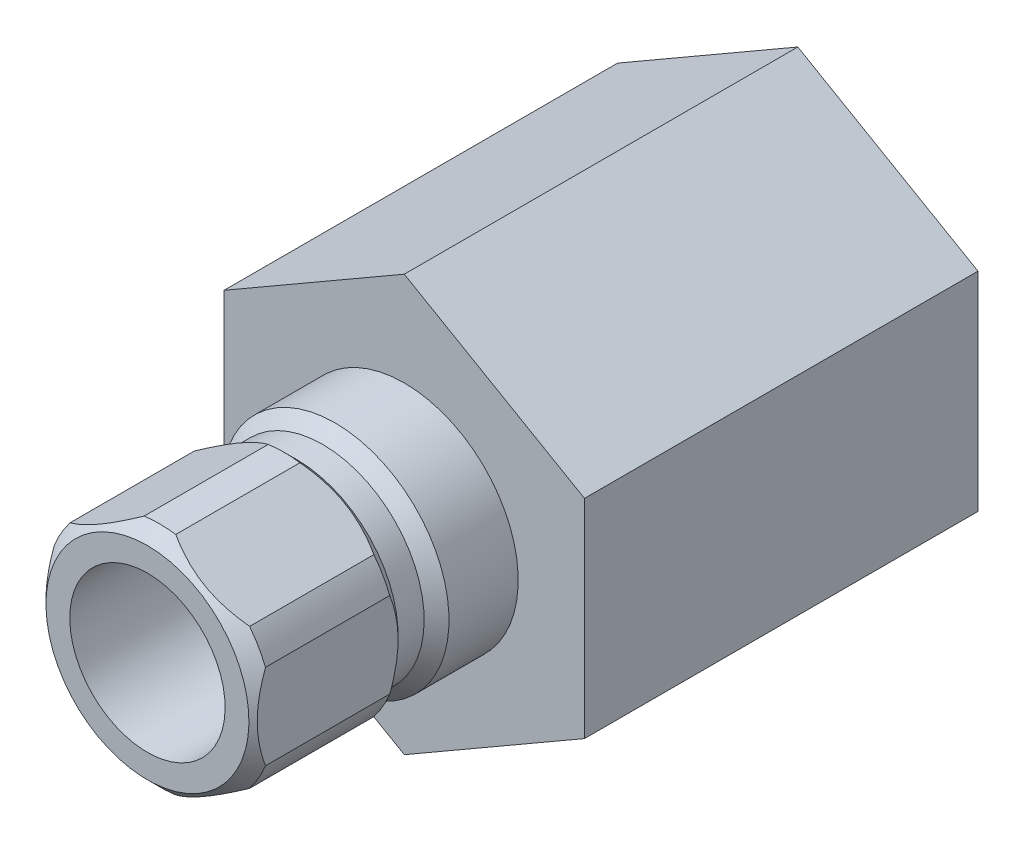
from build123d import *

# Parameters (mm, degrees)
SKETCH2_OUTSIDE_W  = 39.344
SKETCH2_OUTSIDE_H  = 39.344
CUT_EXTRUDE1_DEPTH = 31.514905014
CUT_EXTRUDE2_START = 6.604
SKETCH3_OUTSIDE_W  = 34.548
SKETCH3_OUTSIDE_H  = 37.966
CUT_EXTRUDE2_DEPTH = 23.842751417


with BuildPart() as part:
    # Sketch1 → Revolve1 (revolve)
    with BuildSketch(Plane(origin=(0, 0, 0), x_dir=(0, 0, -1), z_dir=(1, 0, 0))):
        Polygon((-15.748, 4.7625), (-15.748, 6.223), (-14.986, 6.985), (-7.366, 6.985), (-6.604, 6.223), (-5.0038, 6.223), (-4.2418, 6.985), (0, 6.985), (0, 13.208), (24.13, 13.208), (24.13, 9.402839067), (8.9789, 8.92937), (8.9789, 4.7625), align=None)
    revolve(axis=Axis((0, 0, 0), (0, 0, 1)))

    # Sketch2 outside → Cut-Extrude1 (cut, through all)
    with BuildSketch(Plane.XY):
        Rectangle(SKETCH2_OUTSIDE_W, SKETCH2_OUTSIDE_H)
        Polygon((-11.049, 6.379143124), (-11.049, -6.379143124), (0, -12.758286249), (11.049, -6.379143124), (11.049, 6.379143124), (0, 12.758286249), align=None, mode=Mode.SUBTRACT)
    extrude(amount=-CUT_EXTRUDE1_DEPTH, mode=Mode.SUBTRACT)

    # Sketch3 outside → Cut-Extrude2 (cut, through all)
    with BuildSketch(Plane.XY.offset(CUT_EXTRUDE2_START)):
        Rectangle(SKETCH3_OUTSIDE_W, SKETCH3_OUTSIDE_H)
        Polygon((-6.477, 3.739497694), (-6.477, -3.739497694), (0, -7.478995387), (6.477, -3.739497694), (6.477, 3.739497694), (0, 7.478995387), align=None, mode=Mode.SUBTRACT)
    extrude(amount=CUT_EXTRUDE2_DEPTH, mode=Mode.SUBTRACT)


solid = part.part
